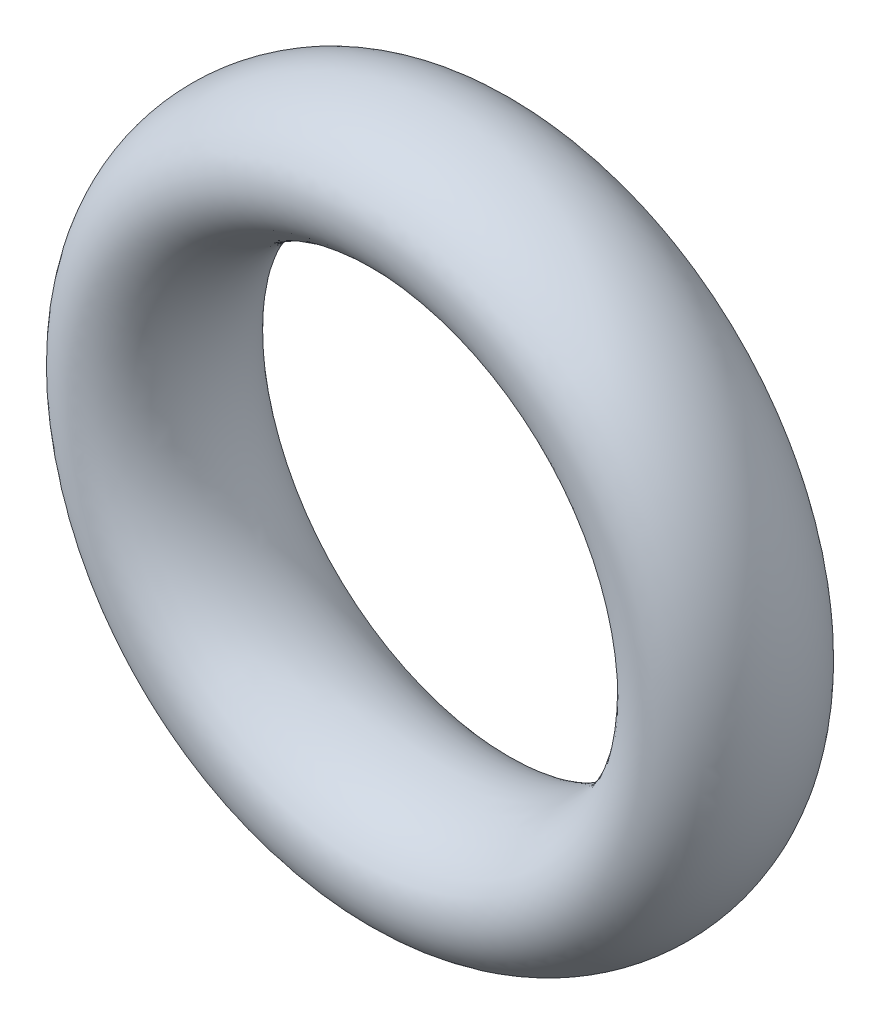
from build123d import *

# Parameters (mm, degrees)
ESQUISSE1_RX = 1
ESQUISSE1_RY = 0.75


with BuildPart() as part:
    # Esquisse1 → Base-R_volution (revolve)
    with BuildSketch(Plane(origin=(0, 0, 0), x_dir=(0, 0, -1), z_dir=(1, 0, 0))):
        with Locations(Location((1, 3.3), (0, 0, 180))):
            Ellipse(ESQUISSE1_RX, ESQUISSE1_RY)
    revolve(axis=Axis((0, 0, 0), (0, 0, -1)))


solid = part.part
